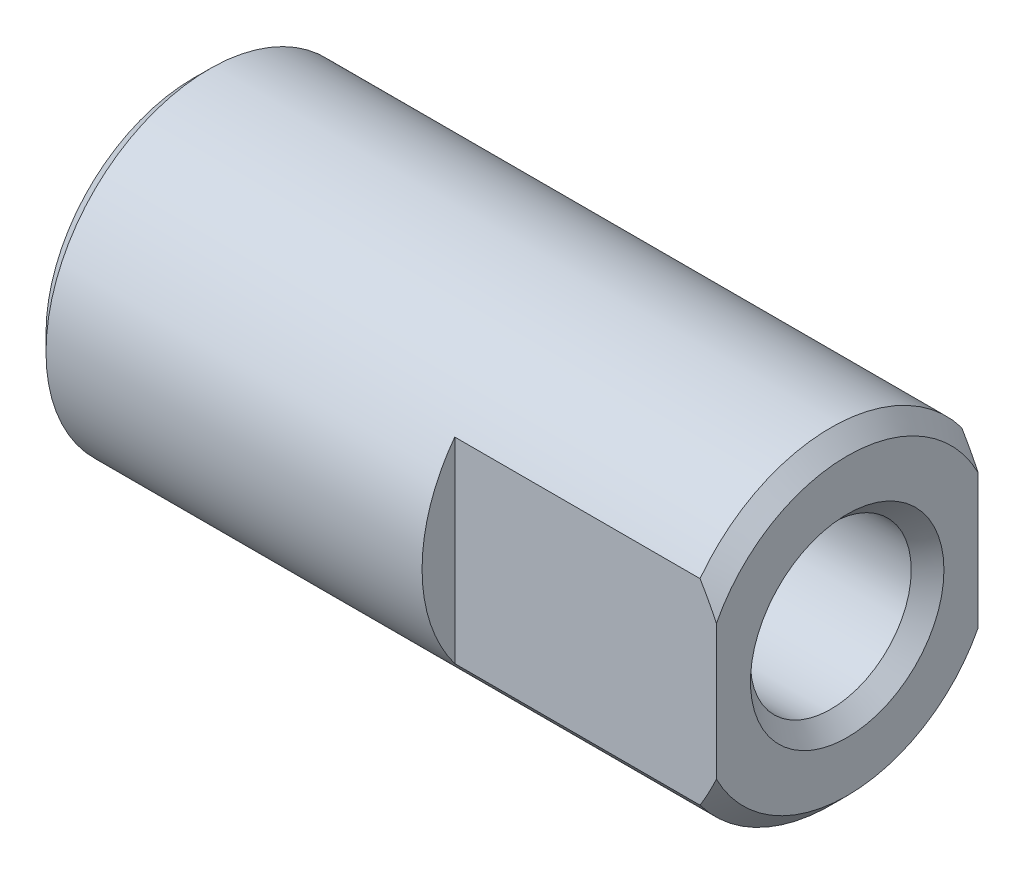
from build123d import *

# Parameters (mm, degrees)
SKETCH1_W          = 20
SKETCH1_H          = 5
CUT_EXTRUDE1_DEPTH = 8
CUT_EXTRUDE2_DEPTH = 8
HOLE1_D            = 4.917
CHAMFER1_SIZE      = 0.5


with BuildPart() as part:
    # Sketch1 → Revolve1 (revolve)
    with BuildSketch(Plane(origin=(0, 0, 0), x_dir=(-1, 0, 0), z_dir=(0, 0, -1)), mode=Mode.PRIVATE) as revolve1_sk:
        with Locations((-10, 2.5)):
            Rectangle(SKETCH1_W, SKETCH1_H)
    revolve(revolve1_sk.sketch.rotate(Axis((20, 0, 0), (-1, 0, 0)), 270), axis=Axis((20, 0, 0), (-1, 0, 0)))

    # Sketch2 → Cut-Extrude1 (cut)
    with BuildSketch(Plane(origin=(20, 0, 0), x_dir=(0, 0, -1), z_dir=(1, 0, 0))):
        with BuildLine():
            Line((4, 3), (4, -3))
            ThreePointArc((4, -3), (5, 0), (4, 3))
        make_face()
    extrude(amount=-CUT_EXTRUDE1_DEPTH, mode=Mode.SUBTRACT)

    # Sketch3 → Cut-Extrude2 (cut)
    with BuildSketch(Plane(origin=(20, 0, 0), x_dir=(0, 0, -1), z_dir=(1, 0, 0))):
        with BuildLine():
            Line((-4, -3), (-4, 3))
            ThreePointArc((-4, 3), (-5, 0), (-4, -3))
        make_face()
    extrude(amount=-CUT_EXTRUDE2_DEPTH, mode=Mode.SUBTRACT)

    # Hole1 (through all)
    with Locations(Plane(origin=(20, 0, 0), x_dir=(0, 0, -1), z_dir=(1, 0, 0))):
        with Locations((0, 0)):
            Hole(HOLE1_D / 2)

    # Chamfer1
    chamfer1_edges = [part.edges().sort_by_distance(p)[0] for p in [
        (20, 5, 0),
        (20, 0, -2.4585),
        (0, 0, -2.4585),
        (0, 0, -5),
        (20, -5, 0),
    ]]
    chamfer(chamfer1_edges, length=CHAMFER1_SIZE)


solid = part.part
